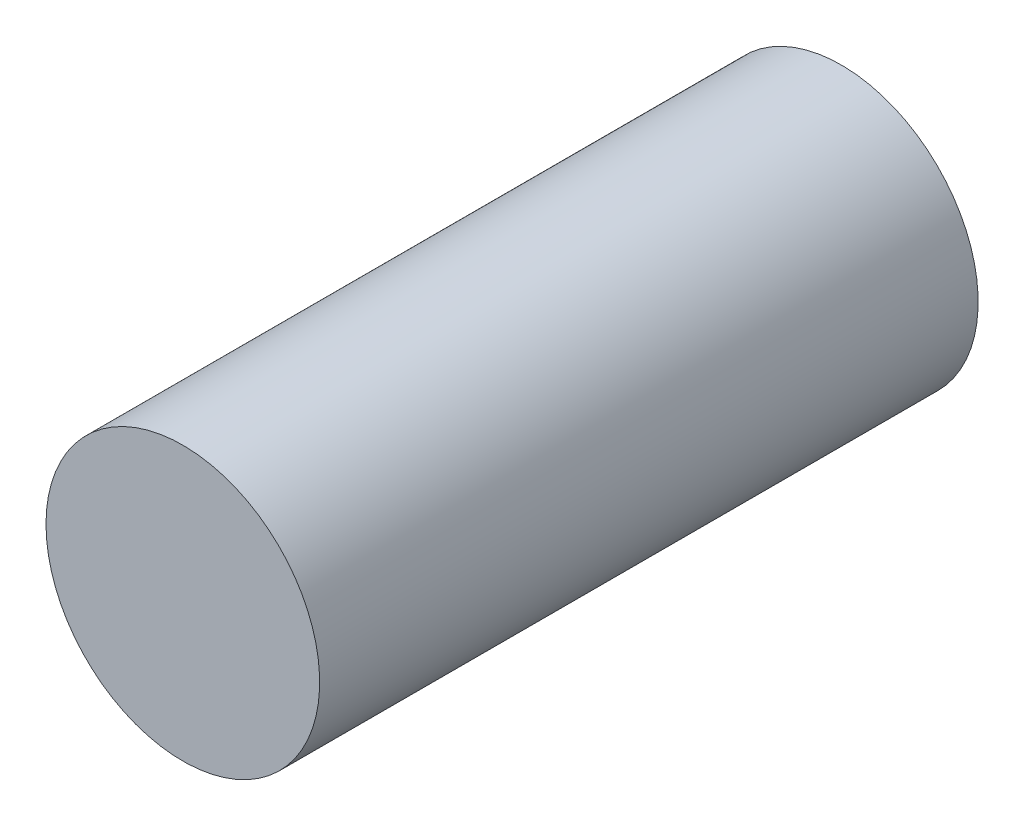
ISO-10303-21;
HEADER;
FILE_DESCRIPTION(('STEP AP214'),'2;1');
FILE_NAME('part.step','',(''),(''),'','','');
FILE_SCHEMA(('AUTOMOTIVE_DESIGN { 1 0 10303 214 1 1 1 1 }'));
ENDSEC;
DATA;
#1=APPLICATION_CONTEXT('core data for automotive mechanical design processes');
#2=APPLICATION_PROTOCOL_DEFINITION('international standard','automotive_design',2000,#1);
#3=PRODUCT_CONTEXT('',#1,'mechanical');
#4=PRODUCT('Part','Part','',(#3));
#5=PRODUCT_RELATED_PRODUCT_CATEGORY('part','',(#4));
#6=PRODUCT_DEFINITION_FORMATION('','',#4);
#7=PRODUCT_DEFINITION_CONTEXT('part definition',#1,'design');
#8=PRODUCT_DEFINITION('design','',#6,#7);
#9=PRODUCT_DEFINITION_SHAPE('','',#8);
#10=(LENGTH_UNIT() NAMED_UNIT(*) SI_UNIT(.MILLI.,.METRE.));
#11=(NAMED_UNIT(*) PLANE_ANGLE_UNIT() SI_UNIT($,.RADIAN.));
#12=(NAMED_UNIT(*) SI_UNIT($,.STERADIAN.) SOLID_ANGLE_UNIT());
#13=UNCERTAINTY_MEASURE_WITH_UNIT(LENGTH_MEASURE(1.E-05),#10,'distance_accuracy_value','');
#14=(GEOMETRIC_REPRESENTATION_CONTEXT(3) GLOBAL_UNCERTAINTY_ASSIGNED_CONTEXT((#13)) GLOBAL_UNIT_ASSIGNED_CONTEXT((#10,
#11,#12)) REPRESENTATION_CONTEXT('',''));
#15=CARTESIAN_POINT('',(0.,0.,0.));
#16=DIRECTION('',(0.,0.,1.));
#17=DIRECTION('',(1.,0.,0.));
#18=AXIS2_PLACEMENT_3D('',#15,#16,#17);
#19=CARTESIAN_POINT('',(0.,0.,3.85));
#20=DIRECTION('',(0.,0.,-1.));
#21=DIRECTION('',(-1.,0.,0.));
#22=AXIS2_PLACEMENT_3D('',#19,#20,#21);
#23=CYLINDRICAL_SURFACE('',#22,0.8);
#24=CARTESIAN_POINT('',(0.,0.,3.85));
#25=DIRECTION('',(0.,0.,1.));
#26=DIRECTION('',(1.,0.,0.));
#27=AXIS2_PLACEMENT_3D('',#24,#25,#26);
#28=CIRCLE('',#27,0.8);
#29=CARTESIAN_POINT('',(-0.8,0.,3.85));
#30=VERTEX_POINT('',#29);
#31=EDGE_CURVE('E10',#30,#30,#28,.T.);
#32=CARTESIAN_POINT('',(0.,0.,0.));
#33=DIRECTION('',(0.,0.,1.));
#34=DIRECTION('',(1.,0.,0.));
#35=AXIS2_PLACEMENT_3D('',#32,#33,#34);
#36=CIRCLE('',#35,0.8);
#37=CARTESIAN_POINT('',(-0.8,0.,0.));
#38=VERTEX_POINT('',#37);
#39=EDGE_CURVE('E36',#38,#38,#36,.T.);
#40=CARTESIAN_POINT('',(-0.8,0.,3.85));
#41=CARTESIAN_POINT('',(-0.8,0.,3.80989583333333));
#42=CARTESIAN_POINT('',(-0.8,0.,3.76979166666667));
#43=CARTESIAN_POINT('',(-0.8,0.,3.68958333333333));
#44=CARTESIAN_POINT('',(-0.8,0.,3.64947916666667));
#45=CARTESIAN_POINT('',(-0.8,0.,3.56927083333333));
#46=CARTESIAN_POINT('',(-0.8,0.,3.52916666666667));
#47=CARTESIAN_POINT('',(-0.8,0.,3.44895833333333));
#48=CARTESIAN_POINT('',(-0.8,0.,3.40885416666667));
#49=CARTESIAN_POINT('',(-0.8,0.,3.32864583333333));
#50=CARTESIAN_POINT('',(-0.8,0.,3.28854166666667));
#51=CARTESIAN_POINT('',(-0.8,0.,3.20833333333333));
#52=CARTESIAN_POINT('',(-0.8,0.,3.16822916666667));
#53=CARTESIAN_POINT('',(-0.8,0.,3.08802083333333));
#54=CARTESIAN_POINT('',(-0.8,0.,3.04791666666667));
#55=CARTESIAN_POINT('',(-0.8,0.,2.96770833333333));
#56=CARTESIAN_POINT('',(-0.8,0.,2.92760416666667));
#57=CARTESIAN_POINT('',(-0.8,0.,2.84739583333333));
#58=CARTESIAN_POINT('',(-0.8,0.,2.80729166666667));
#59=CARTESIAN_POINT('',(-0.8,0.,2.72708333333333));
#60=CARTESIAN_POINT('',(-0.8,0.,2.68697916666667));
#61=CARTESIAN_POINT('',(-0.8,0.,2.60677083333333));
#62=CARTESIAN_POINT('',(-0.8,0.,2.56666666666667));
#63=CARTESIAN_POINT('',(-0.8,0.,2.48645833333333));
#64=CARTESIAN_POINT('',(-0.8,0.,2.44635416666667));
#65=CARTESIAN_POINT('',(-0.8,0.,2.36614583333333));
#66=CARTESIAN_POINT('',(-0.8,0.,2.32604166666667));
#67=CARTESIAN_POINT('',(-0.8,0.,2.24583333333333));
#68=CARTESIAN_POINT('',(-0.8,0.,2.20572916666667));
#69=CARTESIAN_POINT('',(-0.8,0.,2.12552083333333));
#70=CARTESIAN_POINT('',(-0.8,0.,2.08541666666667));
#71=CARTESIAN_POINT('',(-0.8,0.,2.00520833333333));
#72=CARTESIAN_POINT('',(-0.8,0.,1.96510416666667));
#73=CARTESIAN_POINT('',(-0.8,0.,1.88489583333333));
#74=CARTESIAN_POINT('',(-0.8,0.,1.84479166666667));
#75=CARTESIAN_POINT('',(-0.8,0.,1.76458333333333));
#76=CARTESIAN_POINT('',(-0.8,0.,1.72447916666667));
#77=CARTESIAN_POINT('',(-0.8,0.,1.64427083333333));
#78=CARTESIAN_POINT('',(-0.8,0.,1.60416666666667));
#79=CARTESIAN_POINT('',(-0.8,0.,1.52395833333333));
#80=CARTESIAN_POINT('',(-0.8,0.,1.48385416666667));
#81=CARTESIAN_POINT('',(-0.8,0.,1.40364583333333));
#82=CARTESIAN_POINT('',(-0.8,0.,1.36354166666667));
#83=CARTESIAN_POINT('',(-0.8,0.,1.28333333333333));
#84=CARTESIAN_POINT('',(-0.8,0.,1.24322916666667));
#85=CARTESIAN_POINT('',(-0.8,0.,1.16302083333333));
#86=CARTESIAN_POINT('',(-0.8,0.,1.12291666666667));
#87=CARTESIAN_POINT('',(-0.8,0.,1.04270833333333));
#88=CARTESIAN_POINT('',(-0.8,0.,1.00260416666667));
#89=CARTESIAN_POINT('',(-0.8,0.,0.922395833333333));
#90=CARTESIAN_POINT('',(-0.8,0.,0.882291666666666));
#91=CARTESIAN_POINT('',(-0.8,0.,0.802083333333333));
#92=CARTESIAN_POINT('',(-0.8,0.,0.761979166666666));
#93=CARTESIAN_POINT('',(-0.8,0.,0.681770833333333));
#94=CARTESIAN_POINT('',(-0.8,0.,0.641666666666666));
#95=CARTESIAN_POINT('',(-0.8,0.,0.561458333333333));
#96=CARTESIAN_POINT('',(-0.8,0.,0.521354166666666));
#97=CARTESIAN_POINT('',(-0.8,0.,0.441145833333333));
#98=CARTESIAN_POINT('',(-0.8,0.,0.401041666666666));
#99=CARTESIAN_POINT('',(-0.8,0.,0.320833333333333));
#100=CARTESIAN_POINT('',(-0.8,0.,0.280729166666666));
#101=CARTESIAN_POINT('',(-0.8,0.,0.200520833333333));
#102=CARTESIAN_POINT('',(-0.8,0.,0.160416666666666));
#103=CARTESIAN_POINT('',(-0.8,0.,0.080208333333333));
#104=CARTESIAN_POINT('',(-0.8,0.,0.0401041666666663));
#105=CARTESIAN_POINT('',(-0.8,0.,0.));
#106=B_SPLINE_CURVE_WITH_KNOTS('',3,(#40,#41,#42,#43,#44,#45,#46,#47,#48,#49,#50,#51,#52,#53,
#54,#55,#56,#57,#58,#59,#60,#61,#62,#63,#64,#65,#66,#67,#68,#69,#70,#71,#72,#73,#74,#75,#76,#77,
#78,#79,#80,#81,#82,#83,#84,#85,#86,#87,#88,#89,#90,#91,#92,#93,#94,#95,#96,#97,#98,#99,#100,
#101,#102,#103,#104,#105),.UNSPECIFIED.,.F.,.F.,(4,2,2,2,2,2,2,2,2,2,2,2,2,2,2,2,2,2,2,2,2,2,2,
2,2,2,2,2,2,2,2,2,4),(0.,0.1203125,0.240625,0.3609375,0.48125,0.6015625,0.721875,
0.842187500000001,0.9625,1.0828125,1.203125,1.3234375,1.44375,1.5640625,1.684375,1.8046875,
1.925,2.0453125,2.165625,2.2859375,2.40625,2.5265625,2.646875,2.7671875,2.8875,3.0078125,
3.128125,3.2484375,3.36875,3.4890625,3.609375,3.7296875,3.85),.UNSPECIFIED.);
#107=EDGE_CURVE('BSEAM30',#30,#38,#106,.T.);
#108=ORIENTED_EDGE('',*,*,#31,.F.);
#109=ORIENTED_EDGE('',*,*,#39,.T.);
#110=ORIENTED_EDGE('',*,*,#107,.T.);
#111=ORIENTED_EDGE('',*,*,#107,.F.);
#112=EDGE_LOOP('',(#108,#110,#109,#111));
#113=FACE_BOUND('',#112,.T.);
#114=ADVANCED_FACE('F30',(#113),#23,.T.);
#115=CARTESIAN_POINT('',(0.,0.,3.85));
#116=DIRECTION('',(0.,0.,1.));
#117=DIRECTION('',(1.,0.,0.));
#118=AXIS2_PLACEMENT_3D('',#115,#116,#117);
#119=PLANE('',#118);
#120=ORIENTED_EDGE('',*,*,#31,.T.);
#121=EDGE_LOOP('',(#120));
#122=FACE_BOUND('',#121,.T.);
#123=ADVANCED_FACE('F45',(#122),#119,.T.);
#124=CARTESIAN_POINT('',(0.,0.,0.));
#125=DIRECTION('',(0.,0.,1.));
#126=DIRECTION('',(1.,0.,0.));
#127=AXIS2_PLACEMENT_3D('',#124,#125,#126);
#128=PLANE('',#127);
#129=ORIENTED_EDGE('',*,*,#39,.F.);
#130=EDGE_LOOP('',(#129));
#131=FACE_BOUND('',#130,.T.);
#132=ADVANCED_FACE('F43',(#131),#128,.F.);
#133=CLOSED_SHELL('',(#114,#123,#132));
#134=MANIFOLD_SOLID_BREP('B2',#133);
#135=ADVANCED_BREP_SHAPE_REPRESENTATION('',(#18,#134),#14);
#136=SHAPE_DEFINITION_REPRESENTATION(#9,#135);
ENDSEC;
END-ISO-10303-21;
